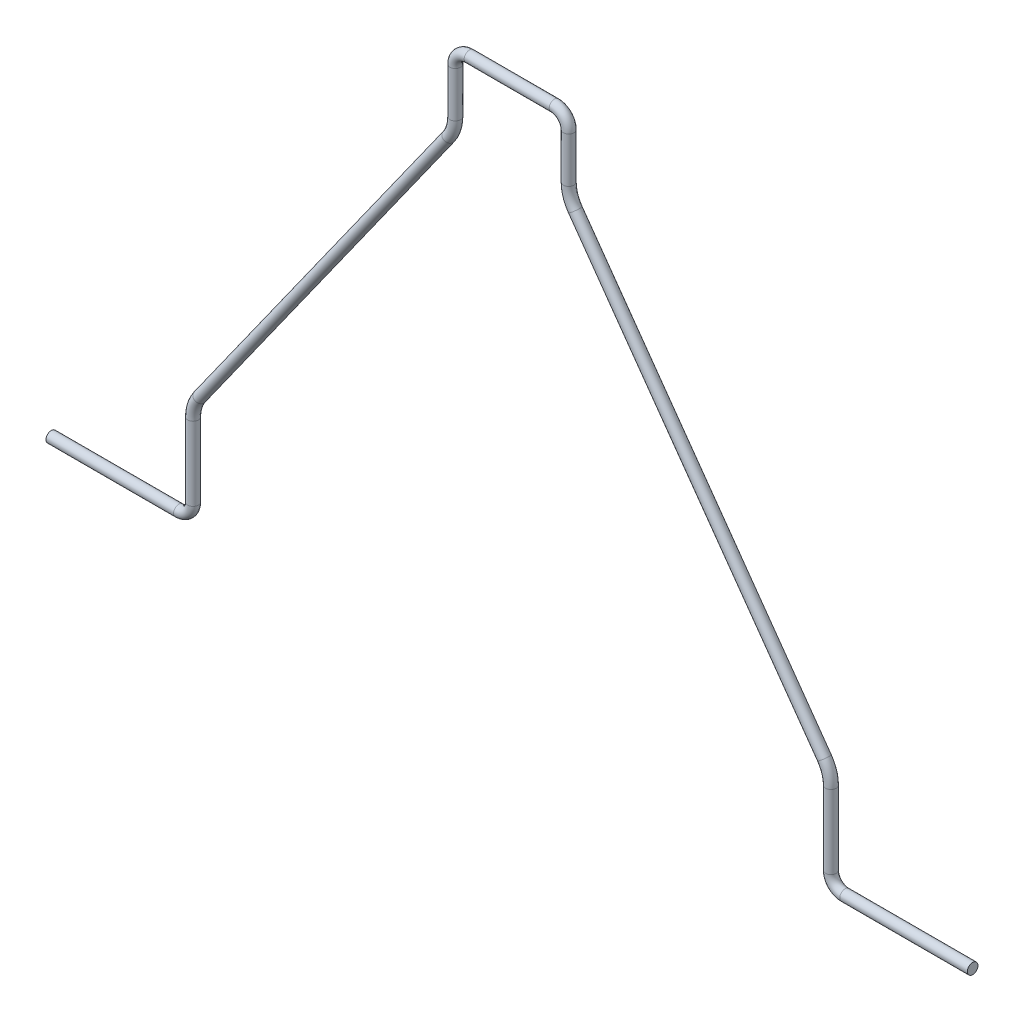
from build123d import *

# Parameters (mm, degrees)
ESQUISSE1_R = 0.75


with BuildPart() as part:
    # Balayage2: sweep along a path in Esquisse2
    with BuildLine(Plane.XY) as balayage2_path:
        Line((0, 0), (18, 0))
        ThreePointArc((18, 0), (19.414213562, 0.585786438), (20, 2))
        Line((20, 2), (20, 12.402694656))
        ThreePointArc((20, 12.402694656), (20.237134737, 13.924244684), (20.926045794, 15.301469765))
        Line((20.926045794, 15.301469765), (56.073954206, 64.698530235))
        ThreePointArc((56.073954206, 64.698530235), (56.762865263, 66.075755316), (57, 67.597305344))
        Line((57, 67.597305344), (57, 74))
        ThreePointArc((57, 74), (57.585786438, 75.414213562), (59, 76))
        Line((59, 76), (71, 76))
        ThreePointArc((71, 76), (72.414213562, 75.414213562), (73, 74))
        Line((73, 74), (73, 67.597305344))
        ThreePointArc((73, 67.597305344), (73.237134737, 66.075755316), (73.926045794, 64.698530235))
        Line((73.926045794, 64.698530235), (109.073954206, 15.301469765))
        ThreePointArc((109.073954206, 15.301469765), (109.762865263, 13.924244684), (110, 12.402694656))
        Line((110, 12.402694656), (110, 2))
        ThreePointArc((110, 2), (110.585786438, 0.585786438), (112, 0))
        Line((112, 0), (130, 0))
    # Esquisse1 → Balayage2 (sweep)
    with BuildSketch(Plane(origin=(0, 0, 0), x_dir=(0, 0, -1), z_dir=(1, 0, 0))):
        Circle(ESQUISSE1_R)
    sweep(path=balayage2_path.line)


solid = part.part
